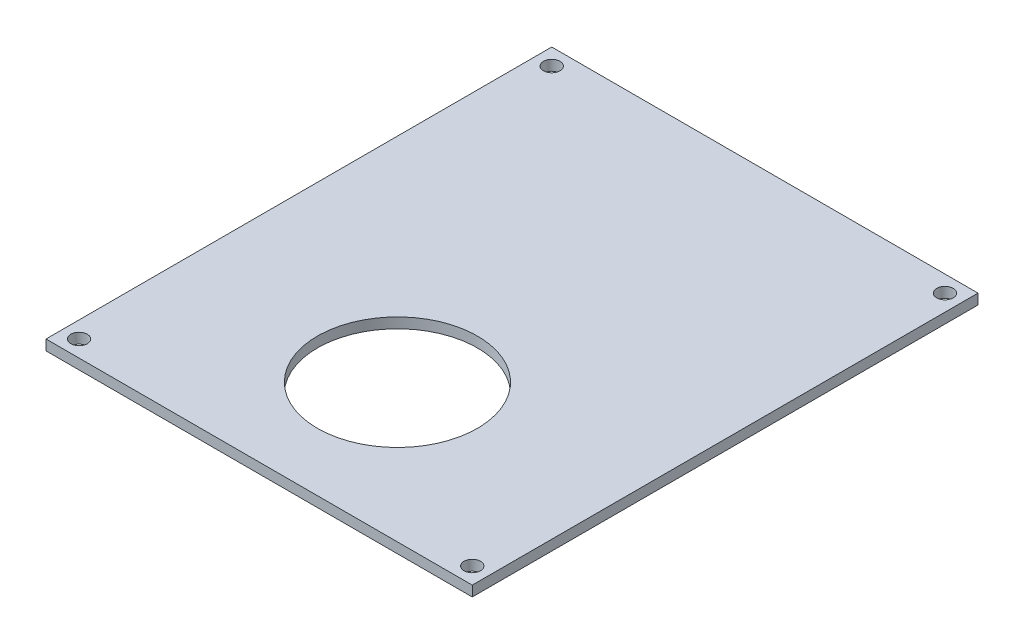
from build123d import *

# Parameters (mm, degrees)
SKETCH1_W                  = 82.6
SKETCH1_H                  = 98
BOSS_EXTRUDE1_DEPTH        = 2
F_3_2_3_2_DIAMETER_HOLE1_D = 3.2
SKETCH4_R                  = 15.5
CUT_EXTRUDE1_DEPTH         = 2


with BuildPart() as part:
    # Sketch1 → Boss-Extrude1 (new body)
    with BuildSketch(Plane(origin=(0, 0, 0), x_dir=(1, 0, 0), z_dir=(0, 1, 0))):
        Rectangle(SKETCH1_W, SKETCH1_H)
    extrude(amount=BOSS_EXTRUDE1_DEPTH)

    # 3.2 _3.2_ Diameter Hole1 (through all)
    with Locations(Plane(origin=(0, 2, 0), x_dir=(1, 0, 0), z_dir=(0, 1, 0))):
        with Locations((-38.1, 45.8), (38.1, 45.8), (38.1, -45.8), (-38.1, -45.8)):
            Hole(F_3_2_3_2_DIAMETER_HOLE1_D / 2)

    # Sketch4 → Cut-Extrude1 (cut)
    with BuildSketch(Plane(origin=(0, 2, 0), x_dir=(1, 0, 0), z_dir=(0, 1, 0))):
        with Locations(Location((0, -22.2, 0), (0, 0, 270))):
            Circle(SKETCH4_R)
    extrude(amount=-CUT_EXTRUDE1_DEPTH, mode=Mode.SUBTRACT)


solid = part.part
